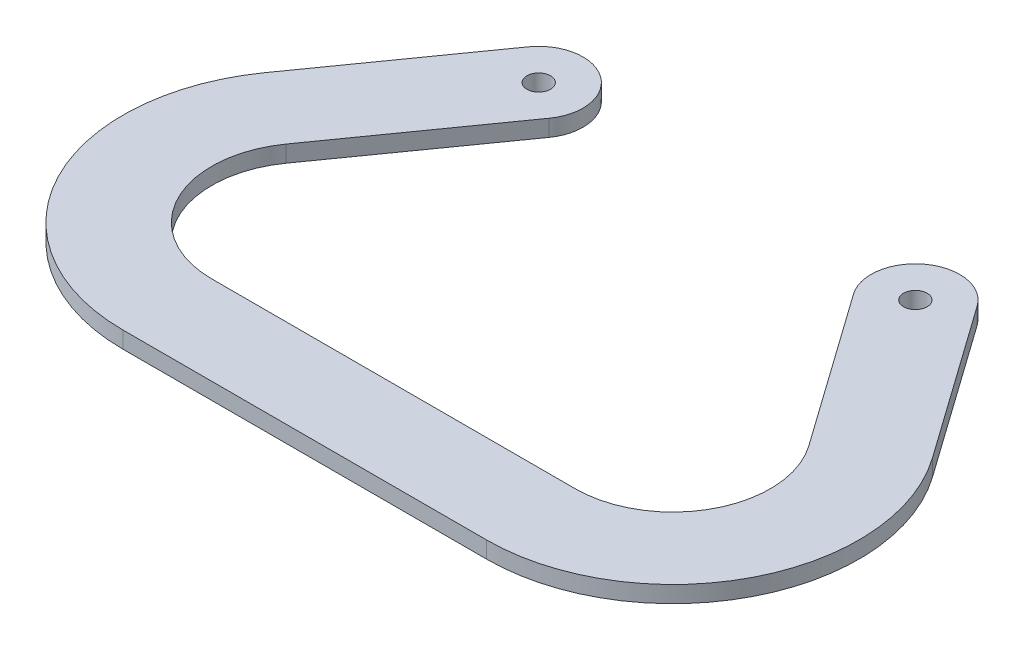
ISO-10303-21;
HEADER;
FILE_DESCRIPTION(('STEP AP214'),'2;1');
FILE_NAME('part.step','',(''),(''),'','','');
FILE_SCHEMA(('AUTOMOTIVE_DESIGN { 1 0 10303 214 1 1 1 1 }'));
ENDSEC;
DATA;
#1=APPLICATION_CONTEXT('core data for automotive mechanical design processes');
#2=APPLICATION_PROTOCOL_DEFINITION('international standard','automotive_design',2000,#1);
#3=PRODUCT_CONTEXT('',#1,'mechanical');
#4=PRODUCT('Part','Part','',(#3));
#5=PRODUCT_RELATED_PRODUCT_CATEGORY('part','',(#4));
#6=PRODUCT_DEFINITION_FORMATION('','',#4);
#7=PRODUCT_DEFINITION_CONTEXT('part definition',#1,'design');
#8=PRODUCT_DEFINITION('design','',#6,#7);
#9=PRODUCT_DEFINITION_SHAPE('','',#8);
#10=(LENGTH_UNIT() NAMED_UNIT(*) SI_UNIT(.MILLI.,.METRE.));
#11=(NAMED_UNIT(*) PLANE_ANGLE_UNIT() SI_UNIT($,.RADIAN.));
#12=(NAMED_UNIT(*) SI_UNIT($,.STERADIAN.) SOLID_ANGLE_UNIT());
#13=UNCERTAINTY_MEASURE_WITH_UNIT(LENGTH_MEASURE(1.E-05),#10,'distance_accuracy_value','');
#14=(GEOMETRIC_REPRESENTATION_CONTEXT(3) GLOBAL_UNCERTAINTY_ASSIGNED_CONTEXT((#13)) GLOBAL_UNIT_ASSIGNED_CONTEXT((#10,
#11,#12)) REPRESENTATION_CONTEXT('',''));
#15=CARTESIAN_POINT('',(0.,0.,0.));
#16=DIRECTION('',(0.,0.,1.));
#17=DIRECTION('',(1.,0.,0.));
#18=AXIS2_PLACEMENT_3D('',#15,#16,#17);
#19=CARTESIAN_POINT('',(52.07,4.7625,0.));
#20=DIRECTION('',(0.,-1.,0.));
#21=DIRECTION('',(0.,0.,-1.));
#22=AXIS2_PLACEMENT_3D('',#19,#20,#21);
#23=CYLINDRICAL_SURFACE('',#22,27.94);
#24=CARTESIAN_POINT('',(52.07,0.,0.));
#25=DIRECTION('',(0.,-1.,0.));
#26=DIRECTION('',(0.,0.,1.));
#27=AXIS2_PLACEMENT_3D('',#24,#25,#26);
#28=CIRCLE('',#27,27.94);
#29=CARTESIAN_POINT('',(74.8576807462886,0.,-16.166793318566));
#30=VERTEX_POINT('',#29);
#31=CARTESIAN_POINT('',(52.07,0.,27.94));
#32=VERTEX_POINT('',#31);
#33=EDGE_CURVE('E157',#30,#32,#28,.T.);
#34=ORIENTED_EDGE('',*,*,#33,.T.);
#35=DIRECTION('',(0.,-1.,0.));
#36=VECTOR('',#35,1.);
#37=CARTESIAN_POINT('',(52.07,4.7625,27.94));
#38=LINE('',#37,#36);
#39=CARTESIAN_POINT('',(52.07,4.7625,27.94));
#40=VERTEX_POINT('',#39);
#41=EDGE_CURVE('E11',#40,#32,#38,.T.);
#42=ORIENTED_EDGE('',*,*,#41,.F.);
#43=CARTESIAN_POINT('',(52.07,4.7625,0.));
#44=DIRECTION('',(0.,-1.,0.));
#45=DIRECTION('',(0.,0.,1.));
#46=AXIS2_PLACEMENT_3D('',#43,#44,#45);
#47=CIRCLE('',#46,27.94);
#48=CARTESIAN_POINT('',(74.8576807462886,4.7625,-16.166793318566));
#49=VERTEX_POINT('',#48);
#50=EDGE_CURVE('E180',#49,#40,#47,.T.);
#51=ORIENTED_EDGE('',*,*,#50,.F.);
#52=DIRECTION('',(0.,-1.,0.));
#53=VECTOR('',#52,1.);
#54=CARTESIAN_POINT('',(74.8576807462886,4.7625,-16.166793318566));
#55=LINE('',#54,#53);
#56=EDGE_CURVE('E153',#49,#30,#55,.T.);
#57=ORIENTED_EDGE('',*,*,#56,.T.);
#58=EDGE_LOOP('',(#34,#42,#51,#57));
#59=FACE_BOUND('',#58,.T.);
#60=ADVANCED_FACE('F37',(#59),#23,.F.);
#61=CARTESIAN_POINT('',(-52.07,4.7625,27.94));
#62=DIRECTION('',(0.,0.,1.));
#63=DIRECTION('',(1.,0.,0.));
#64=AXIS2_PLACEMENT_3D('',#61,#62,#63);
#65=PLANE('',#64);
#66=DIRECTION('',(-1.,0.,0.));
#67=VECTOR('',#66,1.);
#68=CARTESIAN_POINT('',(-52.07,0.,27.94));
#69=LINE('',#68,#67);
#70=CARTESIAN_POINT('',(-52.07,0.,27.94));
#71=VERTEX_POINT('',#70);
#72=EDGE_CURVE('E160',#32,#71,#69,.T.);
#73=ORIENTED_EDGE('',*,*,#72,.T.);
#74=DIRECTION('',(0.,-1.,0.));
#75=VECTOR('',#74,1.);
#76=CARTESIAN_POINT('',(-52.07,4.7625,27.94));
#77=LINE('',#76,#75);
#78=CARTESIAN_POINT('',(-52.07,4.7625,27.94));
#79=VERTEX_POINT('',#78);
#80=EDGE_CURVE('E45',#79,#71,#77,.T.);
#81=ORIENTED_EDGE('',*,*,#80,.F.);
#82=DIRECTION('',(-1.,0.,0.));
#83=VECTOR('',#82,1.);
#84=CARTESIAN_POINT('',(-52.07,4.7625,27.94));
#85=LINE('',#84,#83);
#86=EDGE_CURVE('E108',#40,#79,#85,.T.);
#87=ORIENTED_EDGE('',*,*,#86,.F.);
#88=ORIENTED_EDGE('',*,*,#41,.T.);
#89=EDGE_LOOP('',(#73,#81,#87,#88));
#90=FACE_BOUND('',#89,.T.);
#91=ADVANCED_FACE('F260',(#90),#65,.F.);
#92=CARTESIAN_POINT('',(-52.07,4.7625,0.));
#93=DIRECTION('',(0.,-1.,0.));
#94=DIRECTION('',(0.,0.,-1.));
#95=AXIS2_PLACEMENT_3D('',#92,#93,#94);
#96=CYLINDRICAL_SURFACE('',#95,27.94);
#97=CARTESIAN_POINT('',(-52.07,0.,0.));
#98=DIRECTION('',(0.,-1.,0.));
#99=DIRECTION('',(0.,0.,-1.));
#100=AXIS2_PLACEMENT_3D('',#97,#98,#99);
#101=CIRCLE('',#100,27.94);
#102=CARTESIAN_POINT('',(-74.8576807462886,0.,-16.166793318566));
#103=VERTEX_POINT('',#102);
#104=EDGE_CURVE('E163',#71,#103,#101,.T.);
#105=ORIENTED_EDGE('',*,*,#104,.T.);
#106=DIRECTION('',(0.,-1.,0.));
#107=VECTOR('',#106,1.);
#108=CARTESIAN_POINT('',(-74.8576807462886,4.7625,-16.166793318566));
#109=LINE('',#108,#107);
#110=CARTESIAN_POINT('',(-74.8576807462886,4.7625,-16.166793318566));
#111=VERTEX_POINT('',#110);
#112=EDGE_CURVE('E199',#111,#103,#109,.T.);
#113=ORIENTED_EDGE('',*,*,#112,.F.);
#114=CARTESIAN_POINT('',(-52.07,4.7625,0.));
#115=DIRECTION('',(0.,-1.,0.));
#116=DIRECTION('',(0.,0.,-1.));
#117=AXIS2_PLACEMENT_3D('',#114,#115,#116);
#118=CIRCLE('',#117,27.94);
#119=EDGE_CURVE('E207',#79,#111,#118,.T.);
#120=ORIENTED_EDGE('',*,*,#119,.F.);
#121=ORIENTED_EDGE('',*,*,#80,.T.);
#122=EDGE_LOOP('',(#105,#113,#120,#121));
#123=FACE_BOUND('',#122,.T.);
#124=ADVANCED_FACE('F205',(#123),#96,.F.);
#125=CARTESIAN_POINT('',(-74.8576807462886,4.7625,-16.166793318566));
#126=DIRECTION('',(-0.815593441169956,0.,-0.578625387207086));
#127=DIRECTION('',(-0.578625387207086,0.,0.815593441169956));
#128=AXIS2_PLACEMENT_3D('',#125,#126,#127);
#129=PLANE('',#128);
#130=DIRECTION('',(0.578625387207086,0.,-0.815593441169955));
#131=VECTOR('',#130,1.);
#132=CARTESIAN_POINT('',(-74.8576807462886,0.,-16.166793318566));
#133=LINE('',#132,#131);
#134=CARTESIAN_POINT('',(-43.5874143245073,0.,-60.2433664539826));
#135=VERTEX_POINT('',#134);
#136=EDGE_CURVE('E165',#103,#135,#133,.T.);
#137=ORIENTED_EDGE('',*,*,#136,.T.);
#138=DIRECTION('',(0.,-1.,0.));
#139=VECTOR('',#138,1.);
#140=CARTESIAN_POINT('',(-43.5874143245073,4.7625,-60.2433664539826));
#141=LINE('',#140,#139);
#142=CARTESIAN_POINT('',(-43.5874143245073,4.7625,-60.2433664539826));
#143=VERTEX_POINT('',#142);
#144=EDGE_CURVE('E196',#143,#135,#141,.T.);
#145=ORIENTED_EDGE('',*,*,#144,.F.);
#146=DIRECTION('',(0.578625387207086,0.,-0.815593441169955));
#147=VECTOR('',#146,1.);
#148=CARTESIAN_POINT('',(-74.8576807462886,4.7625,-16.166793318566));
#149=LINE('',#148,#147);
#150=EDGE_CURVE('E225',#111,#143,#149,.T.);
#151=ORIENTED_EDGE('',*,*,#150,.F.);
#152=ORIENTED_EDGE('',*,*,#112,.T.);
#153=EDGE_LOOP('',(#137,#145,#151,#152));
#154=FACE_BOUND('',#153,.T.);
#155=ADVANCED_FACE('F216',(#154),#129,.F.);
#156=CARTESIAN_POINT('',(-53.9454510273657,4.7625,-67.5919088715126));
#157=DIRECTION('',(0.,-1.,0.));
#158=DIRECTION('',(0.,0.,-1.));
#159=AXIS2_PLACEMENT_3D('',#156,#157,#158);
#160=CYLINDRICAL_SURFACE('',#159,12.7);
#161=CARTESIAN_POINT('',(-53.9454510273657,0.,-67.5919088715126));
#162=DIRECTION('',(0.,1.,0.));
#163=DIRECTION('',(0.,0.,-1.));
#164=AXIS2_PLACEMENT_3D('',#161,#162,#163);
#165=CIRCLE('',#164,12.7);
#166=CARTESIAN_POINT('',(-64.3034877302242,0.,-74.9404512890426));
#167=VERTEX_POINT('',#166);
#168=EDGE_CURVE('E167',#135,#167,#165,.T.);
#169=ORIENTED_EDGE('',*,*,#168,.T.);
#170=DIRECTION('',(0.,-1.,0.));
#171=VECTOR('',#170,1.);
#172=CARTESIAN_POINT('',(-64.3034877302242,4.7625,-74.9404512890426));
#173=LINE('',#172,#171);
#174=CARTESIAN_POINT('',(-64.3034877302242,4.7625,-74.9404512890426));
#175=VERTEX_POINT('',#174);
#176=EDGE_CURVE('E193',#175,#167,#173,.T.);
#177=ORIENTED_EDGE('',*,*,#176,.F.);
#178=CARTESIAN_POINT('',(-53.9454510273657,4.7625,-67.5919088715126));
#179=DIRECTION('',(0.,1.,0.));
#180=DIRECTION('',(0.,0.,-1.));
#181=AXIS2_PLACEMENT_3D('',#178,#179,#180);
#182=CIRCLE('',#181,12.7);
#183=EDGE_CURVE('E222',#143,#175,#182,.T.);
#184=ORIENTED_EDGE('',*,*,#183,.F.);
#185=ORIENTED_EDGE('',*,*,#144,.T.);
#186=EDGE_LOOP('',(#169,#177,#184,#185));
#187=FACE_BOUND('',#186,.T.);
#188=ADVANCED_FACE('F220',(#187),#160,.T.);
#189=CARTESIAN_POINT('',(-64.3034877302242,4.7625,-74.9404512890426));
#190=DIRECTION('',(0.815593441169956,0.,0.578625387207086));
#191=DIRECTION('',(0.578625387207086,0.,-0.815593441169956));
#192=AXIS2_PLACEMENT_3D('',#189,#190,#191);
#193=PLANE('',#192);
#194=DIRECTION('',(-0.578625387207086,0.,0.815593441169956));
#195=VECTOR('',#194,1.);
#196=CARTESIAN_POINT('',(-64.3034877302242,0.,-74.9404512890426));
#197=LINE('',#196,#195);
#198=CARTESIAN_POINT('',(-95.5737541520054,0.,-30.863878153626));
#199=VERTEX_POINT('',#198);
#200=EDGE_CURVE('E169',#167,#199,#197,.T.);
#201=ORIENTED_EDGE('',*,*,#200,.T.);
#202=DIRECTION('',(0.,-1.,0.));
#203=VECTOR('',#202,1.);
#204=CARTESIAN_POINT('',(-95.5737541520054,4.7625,-30.863878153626));
#205=LINE('',#204,#203);
#206=CARTESIAN_POINT('',(-95.5737541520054,4.7625,-30.863878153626));
#207=VERTEX_POINT('',#206);
#208=EDGE_CURVE('E190',#207,#199,#205,.T.);
#209=ORIENTED_EDGE('',*,*,#208,.F.);
#210=DIRECTION('',(-0.578625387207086,0.,0.815593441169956));
#211=VECTOR('',#210,1.);
#212=CARTESIAN_POINT('',(-64.3034877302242,4.7625,-74.9404512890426));
#213=LINE('',#212,#211);
#214=EDGE_CURVE('E224',#175,#207,#213,.T.);
#215=ORIENTED_EDGE('',*,*,#214,.F.);
#216=ORIENTED_EDGE('',*,*,#176,.T.);
#217=EDGE_LOOP('',(#201,#209,#215,#216));
#218=FACE_BOUND('',#217,.T.);
#219=ADVANCED_FACE('F273',(#218),#193,.F.);
#220=CARTESIAN_POINT('',(-52.07,4.7625,0.));
#221=DIRECTION('',(0.,-1.,0.));
#222=DIRECTION('',(0.,0.,-1.));
#223=AXIS2_PLACEMENT_3D('',#220,#221,#222);
#224=CYLINDRICAL_SURFACE('',#223,53.34);
#225=CARTESIAN_POINT('',(-52.07,0.,0.));
#226=DIRECTION('',(0.,1.,0.));
#227=DIRECTION('',(0.,0.,-1.));
#228=AXIS2_PLACEMENT_3D('',#225,#226,#227);
#229=CIRCLE('',#228,53.34);
#230=CARTESIAN_POINT('',(-52.07,0.,53.34));
#231=VERTEX_POINT('',#230);
#232=EDGE_CURVE('E171',#199,#231,#229,.T.);
#233=ORIENTED_EDGE('',*,*,#232,.T.);
#234=DIRECTION('',(0.,-1.,0.));
#235=VECTOR('',#234,1.);
#236=CARTESIAN_POINT('',(-52.07,4.7625,53.34));
#237=LINE('',#236,#235);
#238=CARTESIAN_POINT('',(-52.07,4.7625,53.34));
#239=VERTEX_POINT('',#238);
#240=EDGE_CURVE('E187',#239,#231,#237,.T.);
#241=ORIENTED_EDGE('',*,*,#240,.F.);
#242=CARTESIAN_POINT('',(-52.07,4.7625,0.));
#243=DIRECTION('',(0.,1.,0.));
#244=DIRECTION('',(0.,0.,-1.));
#245=AXIS2_PLACEMENT_3D('',#242,#243,#244);
#246=CIRCLE('',#245,53.34);
#247=EDGE_CURVE('E227',#207,#239,#246,.T.);
#248=ORIENTED_EDGE('',*,*,#247,.F.);
#249=ORIENTED_EDGE('',*,*,#208,.T.);
#250=EDGE_LOOP('',(#233,#241,#248,#249));
#251=FACE_BOUND('',#250,.T.);
#252=ADVANCED_FACE('F276',(#251),#224,.T.);
#253=CARTESIAN_POINT('',(52.07,4.7625,53.34));
#254=DIRECTION('',(0.,0.,-1.));
#255=DIRECTION('',(-1.,0.,0.));
#256=AXIS2_PLACEMENT_3D('',#253,#254,#255);
#257=PLANE('',#256);
#258=DIRECTION('',(1.,0.,0.));
#259=VECTOR('',#258,1.);
#260=CARTESIAN_POINT('',(52.07,0.,53.34));
#261=LINE('',#260,#259);
#262=CARTESIAN_POINT('',(52.07,0.,53.34));
#263=VERTEX_POINT('',#262);
#264=EDGE_CURVE('E173',#231,#263,#261,.T.);
#265=ORIENTED_EDGE('',*,*,#264,.T.);
#266=DIRECTION('',(0.,-1.,0.));
#267=VECTOR('',#266,1.);
#268=CARTESIAN_POINT('',(52.07,4.7625,53.34));
#269=LINE('',#268,#267);
#270=CARTESIAN_POINT('',(52.07,4.7625,53.34));
#271=VERTEX_POINT('',#270);
#272=EDGE_CURVE('E184',#271,#263,#269,.T.);
#273=ORIENTED_EDGE('',*,*,#272,.F.);
#274=DIRECTION('',(1.,0.,0.));
#275=VECTOR('',#274,1.);
#276=CARTESIAN_POINT('',(52.07,4.7625,53.34));
#277=LINE('',#276,#275);
#278=EDGE_CURVE('E233',#239,#271,#277,.T.);
#279=ORIENTED_EDGE('',*,*,#278,.F.);
#280=ORIENTED_EDGE('',*,*,#240,.T.);
#281=EDGE_LOOP('',(#265,#273,#279,#280));
#282=FACE_BOUND('',#281,.T.);
#283=ADVANCED_FACE('F239',(#282),#257,.F.);
#284=CARTESIAN_POINT('',(52.07,4.7625,0.));
#285=DIRECTION('',(0.,-1.,0.));
#286=DIRECTION('',(0.,0.,-1.));
#287=AXIS2_PLACEMENT_3D('',#284,#285,#286);
#288=CYLINDRICAL_SURFACE('',#287,53.34);
#289=CARTESIAN_POINT('',(52.07,0.,0.));
#290=DIRECTION('',(0.,1.,0.));
#291=DIRECTION('',(0.,0.,1.));
#292=AXIS2_PLACEMENT_3D('',#289,#290,#291);
#293=CIRCLE('',#292,53.34);
#294=CARTESIAN_POINT('',(95.5737541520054,0.,-30.863878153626));
#295=VERTEX_POINT('',#294);
#296=EDGE_CURVE('E175',#263,#295,#293,.T.);
#297=ORIENTED_EDGE('',*,*,#296,.T.);
#298=DIRECTION('',(0.,-1.,0.));
#299=VECTOR('',#298,1.);
#300=CARTESIAN_POINT('',(95.5737541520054,4.7625,-30.863878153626));
#301=LINE('',#300,#299);
#302=CARTESIAN_POINT('',(95.5737541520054,4.7625,-30.863878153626));
#303=VERTEX_POINT('',#302);
#304=EDGE_CURVE('E148',#303,#295,#301,.T.);
#305=ORIENTED_EDGE('',*,*,#304,.F.);
#306=CARTESIAN_POINT('',(52.07,4.7625,0.));
#307=DIRECTION('',(0.,1.,0.));
#308=DIRECTION('',(0.,0.,1.));
#309=AXIS2_PLACEMENT_3D('',#306,#307,#308);
#310=CIRCLE('',#309,53.34);
#311=EDGE_CURVE('E139',#271,#303,#310,.T.);
#312=ORIENTED_EDGE('',*,*,#311,.F.);
#313=ORIENTED_EDGE('',*,*,#272,.T.);
#314=EDGE_LOOP('',(#297,#305,#312,#313));
#315=FACE_BOUND('',#314,.T.);
#316=ADVANCED_FACE('F243',(#315),#288,.T.);
#317=CARTESIAN_POINT('',(64.3034877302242,4.7625,-74.9404512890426));
#318=DIRECTION('',(-0.815593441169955,0.,0.578625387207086));
#319=DIRECTION('',(0.578625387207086,0.,0.815593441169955));
#320=AXIS2_PLACEMENT_3D('',#317,#318,#319);
#321=PLANE('',#320);
#322=DIRECTION('',(-0.578625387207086,0.,-0.815593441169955));
#323=VECTOR('',#322,1.);
#324=CARTESIAN_POINT('',(64.3034877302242,0.,-74.9404512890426));
#325=LINE('',#324,#323);
#326=CARTESIAN_POINT('',(64.3034877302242,0.,-74.9404512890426));
#327=VERTEX_POINT('',#326);
#328=EDGE_CURVE('E147',#295,#327,#325,.T.);
#329=ORIENTED_EDGE('',*,*,#328,.T.);
#330=DIRECTION('',(0.,-1.,0.));
#331=VECTOR('',#330,1.);
#332=CARTESIAN_POINT('',(64.3034877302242,4.7625,-74.9404512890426));
#333=LINE('',#332,#331);
#334=CARTESIAN_POINT('',(64.3034877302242,4.7625,-74.9404512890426));
#335=VERTEX_POINT('',#334);
#336=EDGE_CURVE('E144',#335,#327,#333,.T.);
#337=ORIENTED_EDGE('',*,*,#336,.F.);
#338=DIRECTION('',(-0.578625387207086,0.,-0.815593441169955));
#339=VECTOR('',#338,1.);
#340=CARTESIAN_POINT('',(64.3034877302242,4.7625,-74.9404512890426));
#341=LINE('',#340,#339);
#342=EDGE_CURVE('E133',#303,#335,#341,.T.);
#343=ORIENTED_EDGE('',*,*,#342,.F.);
#344=ORIENTED_EDGE('',*,*,#304,.T.);
#345=EDGE_LOOP('',(#329,#337,#343,#344));
#346=FACE_BOUND('',#345,.T.);
#347=ADVANCED_FACE('F145',(#346),#321,.F.);
#348=CARTESIAN_POINT('',(53.9454510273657,4.7625,-67.5919088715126));
#349=DIRECTION('',(0.,-1.,0.));
#350=DIRECTION('',(0.,0.,-1.));
#351=AXIS2_PLACEMENT_3D('',#348,#349,#350);
#352=CYLINDRICAL_SURFACE('',#351,12.7);
#353=CARTESIAN_POINT('',(53.9454510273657,0.,-67.5919088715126));
#354=DIRECTION('',(0.,1.,0.));
#355=DIRECTION('',(0.,0.,1.));
#356=AXIS2_PLACEMENT_3D('',#353,#354,#355);
#357=CIRCLE('',#356,12.7);
#358=CARTESIAN_POINT('',(43.5874143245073,0.,-60.2433664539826));
#359=VERTEX_POINT('',#358);
#360=EDGE_CURVE('E94',#327,#359,#357,.T.);
#361=ORIENTED_EDGE('',*,*,#360,.T.);
#362=DIRECTION('',(0.,-1.,0.));
#363=VECTOR('',#362,1.);
#364=CARTESIAN_POINT('',(43.5874143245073,4.7625,-60.2433664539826));
#365=LINE('',#364,#363);
#366=CARTESIAN_POINT('',(43.5874143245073,4.7625,-60.2433664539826));
#367=VERTEX_POINT('',#366);
#368=EDGE_CURVE('E149',#367,#359,#365,.T.);
#369=ORIENTED_EDGE('',*,*,#368,.F.);
#370=CARTESIAN_POINT('',(53.9454510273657,4.7625,-67.5919088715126));
#371=DIRECTION('',(0.,1.,0.));
#372=DIRECTION('',(0.,0.,1.));
#373=AXIS2_PLACEMENT_3D('',#370,#371,#372);
#374=CIRCLE('',#373,12.7);
#375=EDGE_CURVE('E137',#335,#367,#374,.T.);
#376=ORIENTED_EDGE('',*,*,#375,.F.);
#377=ORIENTED_EDGE('',*,*,#336,.T.);
#378=EDGE_LOOP('',(#361,#369,#376,#377));
#379=FACE_BOUND('',#378,.T.);
#380=ADVANCED_FACE('F151',(#379),#352,.T.);
#381=CARTESIAN_POINT('',(74.8576807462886,4.7625,-16.166793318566));
#382=DIRECTION('',(0.815593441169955,0.,-0.578625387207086));
#383=DIRECTION('',(-0.578625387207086,0.,-0.815593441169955));
#384=AXIS2_PLACEMENT_3D('',#381,#382,#383);
#385=PLANE('',#384);
#386=DIRECTION('',(0.578625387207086,0.,0.815593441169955));
#387=VECTOR('',#386,1.);
#388=CARTESIAN_POINT('',(74.8576807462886,0.,-16.166793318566));
#389=LINE('',#388,#387);
#390=EDGE_CURVE('E100',#359,#30,#389,.T.);
#391=ORIENTED_EDGE('',*,*,#390,.T.);
#392=ORIENTED_EDGE('',*,*,#56,.F.);
#393=DIRECTION('',(0.578625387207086,0.,0.815593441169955));
#394=VECTOR('',#393,1.);
#395=CARTESIAN_POINT('',(74.8576807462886,4.7625,-16.166793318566));
#396=LINE('',#395,#394);
#397=EDGE_CURVE('E53',#367,#49,#396,.T.);
#398=ORIENTED_EDGE('',*,*,#397,.F.);
#399=ORIENTED_EDGE('',*,*,#368,.T.);
#400=EDGE_LOOP('',(#391,#392,#398,#399));
#401=FACE_BOUND('',#400,.T.);
#402=ADVANCED_FACE('F247',(#401),#385,.F.);
#403=CARTESIAN_POINT('',(52.07,4.7625,0.));
#404=DIRECTION('',(0.,1.,0.));
#405=DIRECTION('',(0.,0.,1.));
#406=AXIS2_PLACEMENT_3D('',#403,#404,#405);
#407=PLANE('',#406);
#408=CARTESIAN_POINT('',(-53.9454510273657,4.7625,-67.5919088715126));
#409=DIRECTION('',(0.,1.,0.));
#410=DIRECTION('',(0.,0.,1.));
#411=AXIS2_PLACEMENT_3D('',#408,#409,#410);
#412=CIRCLE('',#411,3.373501);
#413=CARTESIAN_POINT('',(-53.9454510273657,4.7625,-64.2184078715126));
#414=VERTEX_POINT('',#413);
#415=EDGE_CURVE('E337',#414,#414,#412,.T.);
#416=ORIENTED_EDGE('',*,*,#415,.F.);
#417=EDGE_LOOP('',(#416));
#418=FACE_BOUND('',#417,.T.);
#419=CARTESIAN_POINT('',(53.9454510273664,4.7625,-67.5919088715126));
#420=DIRECTION('',(0.,1.,0.));
#421=DIRECTION('',(0.,0.,1.));
#422=AXIS2_PLACEMENT_3D('',#419,#420,#421);
#423=CIRCLE('',#422,3.373501);
#424=CARTESIAN_POINT('',(53.9454510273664,4.7625,-64.2184078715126));
#425=VERTEX_POINT('',#424);
#426=EDGE_CURVE('E339',#425,#425,#423,.T.);
#427=ORIENTED_EDGE('',*,*,#426,.F.);
#428=EDGE_LOOP('',(#427));
#429=FACE_BOUND('',#428,.T.);
#430=ORIENTED_EDGE('',*,*,#50,.T.);
#431=ORIENTED_EDGE('',*,*,#86,.T.);
#432=ORIENTED_EDGE('',*,*,#119,.T.);
#433=ORIENTED_EDGE('',*,*,#150,.T.);
#434=ORIENTED_EDGE('',*,*,#183,.T.);
#435=ORIENTED_EDGE('',*,*,#214,.T.);
#436=ORIENTED_EDGE('',*,*,#247,.T.);
#437=ORIENTED_EDGE('',*,*,#278,.T.);
#438=ORIENTED_EDGE('',*,*,#311,.T.);
#439=ORIENTED_EDGE('',*,*,#342,.T.);
#440=ORIENTED_EDGE('',*,*,#375,.T.);
#441=ORIENTED_EDGE('',*,*,#397,.T.);
#442=EDGE_LOOP('',(#430,#431,#432,#433,#434,#435,#436,#437,#438,#439,#440,#441));
#443=FACE_BOUND('',#442,.T.);
#444=ADVANCED_FACE('F135',(#418,#429,#443),#407,.T.);
#445=CARTESIAN_POINT('',(52.07,0.,0.));
#446=DIRECTION('',(0.,1.,0.));
#447=DIRECTION('',(0.,0.,1.));
#448=AXIS2_PLACEMENT_3D('',#445,#446,#447);
#449=PLANE('',#448);
#450=CARTESIAN_POINT('',(-53.9454510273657,0.,-67.5919088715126));
#451=DIRECTION('',(0.,1.,0.));
#452=DIRECTION('',(0.,0.,1.));
#453=AXIS2_PLACEMENT_3D('',#450,#451,#452);
#454=CIRCLE('',#453,3.373501);
#455=CARTESIAN_POINT('',(-53.9454510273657,0.,-64.2184078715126));
#456=VERTEX_POINT('',#455);
#457=EDGE_CURVE('E334',#456,#456,#454,.T.);
#458=ORIENTED_EDGE('',*,*,#457,.T.);
#459=EDGE_LOOP('',(#458));
#460=FACE_BOUND('',#459,.T.);
#461=CARTESIAN_POINT('',(53.9454510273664,0.,-67.5919088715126));
#462=DIRECTION('',(0.,1.,0.));
#463=DIRECTION('',(0.,0.,1.));
#464=AXIS2_PLACEMENT_3D('',#461,#462,#463);
#465=CIRCLE('',#464,3.373501);
#466=CARTESIAN_POINT('',(53.9454510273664,0.,-64.2184078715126));
#467=VERTEX_POINT('',#466);
#468=EDGE_CURVE('E161',#467,#467,#465,.T.);
#469=ORIENTED_EDGE('',*,*,#468,.T.);
#470=EDGE_LOOP('',(#469));
#471=FACE_BOUND('',#470,.T.);
#472=ORIENTED_EDGE('',*,*,#33,.F.);
#473=ORIENTED_EDGE('',*,*,#390,.F.);
#474=ORIENTED_EDGE('',*,*,#360,.F.);
#475=ORIENTED_EDGE('',*,*,#328,.F.);
#476=ORIENTED_EDGE('',*,*,#296,.F.);
#477=ORIENTED_EDGE('',*,*,#264,.F.);
#478=ORIENTED_EDGE('',*,*,#232,.F.);
#479=ORIENTED_EDGE('',*,*,#200,.F.);
#480=ORIENTED_EDGE('',*,*,#168,.F.);
#481=ORIENTED_EDGE('',*,*,#136,.F.);
#482=ORIENTED_EDGE('',*,*,#104,.F.);
#483=ORIENTED_EDGE('',*,*,#72,.F.);
#484=EDGE_LOOP('',(#472,#473,#474,#475,#476,#477,#478,#479,#480,#481,#482,#483));
#485=FACE_BOUND('',#484,.T.);
#486=ADVANCED_FACE('F211',(#460,#471,#485),#449,.F.);
#487=CARTESIAN_POINT('',(53.9454510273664,4.7625,-67.5919088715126));
#488=DIRECTION('',(0.,1.,0.));
#489=DIRECTION('',(0.,0.,1.));
#490=AXIS2_PLACEMENT_3D('',#487,#488,#489);
#491=CYLINDRICAL_SURFACE('',#490,3.373501);
#492=ORIENTED_EDGE('',*,*,#468,.F.);
#493=EDGE_LOOP('',(#492));
#494=FACE_BOUND('',#493,.T.);
#495=ORIENTED_EDGE('',*,*,#426,.T.);
#496=EDGE_LOOP('',(#495));
#497=FACE_BOUND('',#496,.T.);
#498=ADVANCED_FACE('F309',(#494,#497),#491,.F.);
#499=CARTESIAN_POINT('',(-53.9454510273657,4.7625,-67.5919088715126));
#500=DIRECTION('',(0.,1.,0.));
#501=DIRECTION('',(0.,0.,1.));
#502=AXIS2_PLACEMENT_3D('',#499,#500,#501);
#503=CYLINDRICAL_SURFACE('',#502,3.373501);
#504=ORIENTED_EDGE('',*,*,#457,.F.);
#505=EDGE_LOOP('',(#504));
#506=FACE_BOUND('',#505,.T.);
#507=ORIENTED_EDGE('',*,*,#415,.T.);
#508=EDGE_LOOP('',(#507));
#509=FACE_BOUND('',#508,.T.);
#510=ADVANCED_FACE('F317',(#506,#509),#503,.F.);
#511=CLOSED_SHELL('',(#60,#91,#124,#155,#188,#219,#252,#283,#316,#347,#380,#402,#444,#486,#498,#510));
#512=MANIFOLD_SOLID_BREP('B2',#511);
#513=ADVANCED_BREP_SHAPE_REPRESENTATION('',(#18,#512),#14);
#514=SHAPE_DEFINITION_REPRESENTATION(#9,#513);
ENDSEC;
END-ISO-10303-21;
